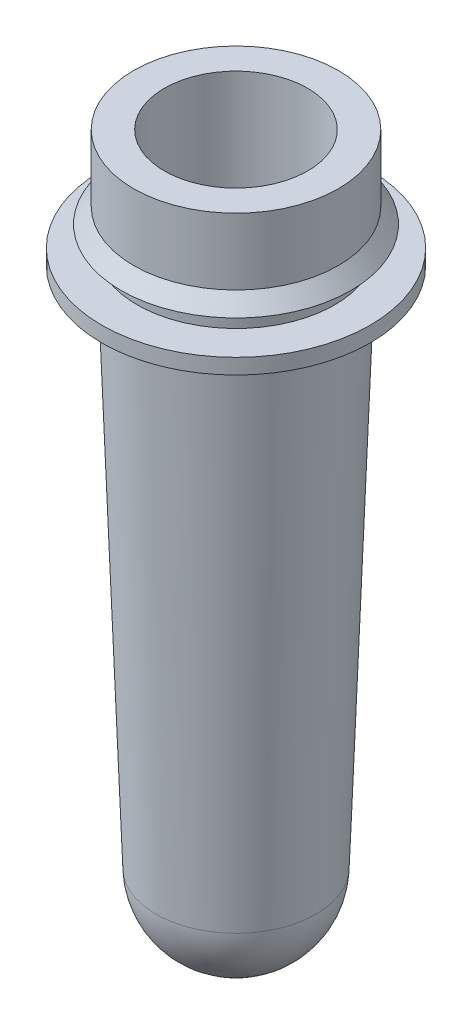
ISO-10303-21;
HEADER;
FILE_DESCRIPTION(('STEP AP214'),'2;1');
FILE_NAME('part.step','',(''),(''),'','','');
FILE_SCHEMA(('AUTOMOTIVE_DESIGN { 1 0 10303 214 1 1 1 1 }'));
ENDSEC;
DATA;
#1=APPLICATION_CONTEXT('core data for automotive mechanical design processes');
#2=APPLICATION_PROTOCOL_DEFINITION('international standard','automotive_design',2000,#1);
#3=PRODUCT_CONTEXT('',#1,'mechanical');
#4=PRODUCT('Part','Part','',(#3));
#5=PRODUCT_RELATED_PRODUCT_CATEGORY('part','',(#4));
#6=PRODUCT_DEFINITION_FORMATION('','',#4);
#7=PRODUCT_DEFINITION_CONTEXT('part definition',#1,'design');
#8=PRODUCT_DEFINITION('design','',#6,#7);
#9=PRODUCT_DEFINITION_SHAPE('','',#8);
#10=(LENGTH_UNIT() NAMED_UNIT(*) SI_UNIT(.MILLI.,.METRE.));
#11=(NAMED_UNIT(*) PLANE_ANGLE_UNIT() SI_UNIT($,.RADIAN.));
#12=(NAMED_UNIT(*) SI_UNIT($,.STERADIAN.) SOLID_ANGLE_UNIT());
#13=UNCERTAINTY_MEASURE_WITH_UNIT(LENGTH_MEASURE(1.E-05),#10,'distance_accuracy_value','');
#14=(GEOMETRIC_REPRESENTATION_CONTEXT(3) GLOBAL_UNCERTAINTY_ASSIGNED_CONTEXT((#13)) GLOBAL_UNIT_ASSIGNED_CONTEXT((#10,
#11,#12)) REPRESENTATION_CONTEXT('',''));
#15=CARTESIAN_POINT('',(0.,0.,0.));
#16=DIRECTION('',(0.,0.,1.));
#17=DIRECTION('',(1.,0.,0.));
#18=AXIS2_PLACEMENT_3D('',#15,#16,#17);
#19=CARTESIAN_POINT('',(0.,58.5,0.));
#20=DIRECTION('',(0.,1.,0.));
#21=DIRECTION('',(0.,0.,1.));
#22=AXIS2_PLACEMENT_3D('',#19,#20,#21);
#23=CONICAL_SURFACE('',#22,6.5965825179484,0.0349065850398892);
#24=CARTESIAN_POINT('',(0.,7.65564199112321,0.));
#25=DIRECTION('',(0.,-1.,0.));
#26=DIRECTION('',(0.,0.,-1.));
#27=AXIS2_PLACEMENT_3D('',#24,#25,#26);
#28=CIRCLE('',#27,4.82105841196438);
#29=CARTESIAN_POINT('',(0.,7.65564199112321,-4.82105841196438));
#30=VERTEX_POINT('',#29);
#31=EDGE_CURVE('E10',#30,#30,#28,.T.);
#32=ORIENTED_EDGE('',*,*,#31,.T.);
#33=EDGE_LOOP('',(#32));
#34=FACE_BOUND('',#33,.T.);
#35=CARTESIAN_POINT('',(0.,58.5,0.));
#36=DIRECTION('',(0.,-1.,0.));
#37=DIRECTION('',(0.,0.,-1.));
#38=AXIS2_PLACEMENT_3D('',#35,#36,#37);
#39=CIRCLE('',#38,6.59658251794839);
#40=CARTESIAN_POINT('',(0.,58.5,-6.59658251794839));
#41=VERTEX_POINT('',#40);
#42=EDGE_CURVE('E78',#41,#41,#39,.T.);
#43=ORIENTED_EDGE('',*,*,#42,.F.);
#44=EDGE_LOOP('',(#43));
#45=FACE_BOUND('',#44,.T.);
#46=ADVANCED_FACE('F35',(#34,#45),#23,.F.);
#47=CARTESIAN_POINT('',(0.,7.82399706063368,0.));
#48=DIRECTION('',(0.,-1.,0.));
#49=DIRECTION('',(0.,0.,-1.));
#50=AXIS2_PLACEMENT_3D('',#47,#48,#49);
#51=SPHERICAL_SURFACE('',#50,4.82399706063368);
#52=ORIENTED_EDGE('',*,*,#31,.F.);
#53=EDGE_LOOP('',(#52));
#54=FACE_BOUND('',#53,.T.);
#55=ADVANCED_FACE('F86',(#54),#51,.F.);
#56=CARTESIAN_POINT('',(0.,7.82399706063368,0.));
#57=DIRECTION('',(0.,-1.,0.));
#58=DIRECTION('',(0.,0.,-1.));
#59=AXIS2_PLACEMENT_3D('',#56,#57,#58);
#60=SPHERICAL_SURFACE('',#59,7.82399706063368);
#61=CARTESIAN_POINT('',(0.,7.5509435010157,0.));
#62=DIRECTION('',(0.,-1.,0.));
#63=DIRECTION('',(0.,0.,-1.));
#64=AXIS2_PLACEMENT_3D('',#61,#62,#63);
#65=CIRCLE('',#64,7.81923089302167);
#66=CARTESIAN_POINT('',(0.,7.5509435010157,-7.81923089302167));
#67=VERTEX_POINT('',#66);
#68=EDGE_CURVE('E41',#67,#67,#65,.T.);
#69=ORIENTED_EDGE('',*,*,#68,.T.);
#70=EDGE_LOOP('',(#69));
#71=FACE_BOUND('',#70,.T.);
#72=ADVANCED_FACE('F90',(#71),#60,.T.);
#73=CARTESIAN_POINT('',(0.,58.5,0.));
#74=DIRECTION('',(0.,1.,0.));
#75=DIRECTION('',(0.,0.,1.));
#76=AXIS2_PLACEMENT_3D('',#73,#74,#75);
#77=CONICAL_SURFACE('',#76,9.59841115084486,0.0349065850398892);
#78=ORIENTED_EDGE('',*,*,#68,.F.);
#79=EDGE_LOOP('',(#78));
#80=FACE_BOUND('',#79,.T.);
#81=CARTESIAN_POINT('',(0.,58.5,0.));
#82=DIRECTION('',(0.,-1.,0.));
#83=DIRECTION('',(0.,0.,-1.));
#84=AXIS2_PLACEMENT_3D('',#81,#82,#83);
#85=CIRCLE('',#84,9.59841115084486);
#86=CARTESIAN_POINT('',(0.,58.5,-9.59841115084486));
#87=VERTEX_POINT('',#86);
#88=EDGE_CURVE('E45',#87,#87,#85,.T.);
#89=ORIENTED_EDGE('',*,*,#88,.T.);
#90=EDGE_LOOP('',(#89));
#91=FACE_BOUND('',#90,.T.);
#92=ADVANCED_FACE('F95',(#80,#91),#77,.T.);
#93=CARTESIAN_POINT('',(0.,58.5,0.));
#94=DIRECTION('',(0.,1.,0.));
#95=DIRECTION('',(0.,0.,1.));
#96=AXIS2_PLACEMENT_3D('',#93,#94,#95);
#97=PLANE('',#96);
#98=ORIENTED_EDGE('',*,*,#88,.F.);
#99=EDGE_LOOP('',(#98));
#100=FACE_BOUND('',#99,.T.);
#101=CARTESIAN_POINT('',(0.,58.5,0.));
#102=DIRECTION('',(0.,-1.,0.));
#103=DIRECTION('',(0.,0.,-1.));
#104=AXIS2_PLACEMENT_3D('',#101,#102,#103);
#105=CIRCLE('',#104,13.0984111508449);
#106=CARTESIAN_POINT('',(0.,58.5,-13.0984111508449));
#107=VERTEX_POINT('',#106);
#108=EDGE_CURVE('E49',#107,#107,#105,.T.);
#109=ORIENTED_EDGE('',*,*,#108,.T.);
#110=EDGE_LOOP('',(#109));
#111=FACE_BOUND('',#110,.T.);
#112=ADVANCED_FACE('F100',(#100,#111),#97,.F.);
#113=CARTESIAN_POINT('',(0.,0.,0.));
#114=DIRECTION('',(0.,-1.,0.));
#115=DIRECTION('',(0.,0.,-1.));
#116=AXIS2_PLACEMENT_3D('',#113,#114,#115);
#117=CYLINDRICAL_SURFACE('',#116,13.0984111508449);
#118=ORIENTED_EDGE('',*,*,#108,.F.);
#119=EDGE_LOOP('',(#118));
#120=FACE_BOUND('',#119,.T.);
#121=CARTESIAN_POINT('',(0.,60.,0.));
#122=DIRECTION('',(0.,-1.,0.));
#123=DIRECTION('',(0.,0.,-1.));
#124=AXIS2_PLACEMENT_3D('',#121,#122,#123);
#125=CIRCLE('',#124,13.0984111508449);
#126=CARTESIAN_POINT('',(0.,60.,-13.0984111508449));
#127=VERTEX_POINT('',#126);
#128=EDGE_CURVE('E54',#127,#127,#125,.T.);
#129=ORIENTED_EDGE('',*,*,#128,.T.);
#130=EDGE_LOOP('',(#129));
#131=FACE_BOUND('',#130,.T.);
#132=ADVANCED_FACE('F104',(#120,#131),#117,.T.);
#133=CARTESIAN_POINT('',(0.,60.,1.20759762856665E-13));
#134=DIRECTION('',(0.,-1.,0.));
#135=DIRECTION('',(0.,0.,-1.));
#136=AXIS2_PLACEMENT_3D('',#133,#134,#135);
#137=PLANE('',#136);
#138=ORIENTED_EDGE('',*,*,#128,.F.);
#139=EDGE_LOOP('',(#138));
#140=FACE_BOUND('',#139,.T.);
#141=CARTESIAN_POINT('',(0.,60.,0.));
#142=DIRECTION('',(0.,-1.,0.));
#143=DIRECTION('',(0.,0.,-1.));
#144=AXIS2_PLACEMENT_3D('',#141,#142,#143);
#145=CIRCLE('',#144,9.65079230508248);
#146=CARTESIAN_POINT('',(0.,60.,-9.65079230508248));
#147=VERTEX_POINT('',#146);
#148=EDGE_CURVE('E57',#147,#147,#145,.T.);
#149=ORIENTED_EDGE('',*,*,#148,.T.);
#150=EDGE_LOOP('',(#149));
#151=FACE_BOUND('',#150,.T.);
#152=ADVANCED_FACE('F108',(#140,#151),#137,.F.);
#153=CARTESIAN_POINT('',(0.,62.,0.));
#154=DIRECTION('',(0.,1.,0.));
#155=DIRECTION('',(0.,0.,1.));
#156=AXIS2_PLACEMENT_3D('',#153,#154,#155);
#157=CONICAL_SURFACE('',#156,9.72063384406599,0.0349065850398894);
#158=ORIENTED_EDGE('',*,*,#148,.F.);
#159=EDGE_LOOP('',(#158));
#160=FACE_BOUND('',#159,.T.);
#161=CARTESIAN_POINT('',(0.,62.,0.));
#162=DIRECTION('',(0.,-1.,0.));
#163=DIRECTION('',(0.,0.,-1.));
#164=AXIS2_PLACEMENT_3D('',#161,#162,#163);
#165=CIRCLE('',#164,9.72063384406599);
#166=CARTESIAN_POINT('',(0.,62.,-9.72063384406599));
#167=VERTEX_POINT('',#166);
#168=EDGE_CURVE('E60',#167,#167,#165,.T.);
#169=ORIENTED_EDGE('',*,*,#168,.T.);
#170=EDGE_LOOP('',(#169));
#171=FACE_BOUND('',#170,.T.);
#172=ADVANCED_FACE('F112',(#160,#171),#157,.T.);
#173=CARTESIAN_POINT('',(0.,62.,2.86807614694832E-13));
#174=DIRECTION('',(0.,1.,0.));
#175=DIRECTION('',(0.,0.,1.));
#176=AXIS2_PLACEMENT_3D('',#173,#174,#175);
#177=PLANE('',#176);
#178=ORIENTED_EDGE('',*,*,#168,.F.);
#179=EDGE_LOOP('',(#178));
#180=FACE_BOUND('',#179,.T.);
#181=CARTESIAN_POINT('',(0.,62.,0.));
#182=DIRECTION('',(0.,-1.,0.));
#183=DIRECTION('',(0.,0.,-1.));
#184=AXIS2_PLACEMENT_3D('',#181,#182,#183);
#185=CIRCLE('',#184,11.220633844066);
#186=CARTESIAN_POINT('',(0.,62.,-11.220633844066));
#187=VERTEX_POINT('',#186);
#188=EDGE_CURVE('E63',#187,#187,#185,.T.);
#189=ORIENTED_EDGE('',*,*,#188,.T.);
#190=EDGE_LOOP('',(#189));
#191=FACE_BOUND('',#190,.T.);
#192=ADVANCED_FACE('F116',(#180,#191),#177,.F.);
#193=CARTESIAN_POINT('',(0.,63.5,0.));
#194=DIRECTION('',(0.,-1.,0.));
#195=DIRECTION('',(0.,0.,-1.));
#196=AXIS2_PLACEMENT_3D('',#193,#194,#195);
#197=CONICAL_SURFACE('',#196,9.99999999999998,0.683072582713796);
#198=ORIENTED_EDGE('',*,*,#188,.F.);
#199=EDGE_LOOP('',(#198));
#200=FACE_BOUND('',#199,.T.);
#201=CARTESIAN_POINT('',(0.,63.5,0.));
#202=DIRECTION('',(0.,-1.,0.));
#203=DIRECTION('',(0.,0.,-1.));
#204=AXIS2_PLACEMENT_3D('',#201,#202,#203);
#205=CIRCLE('',#204,9.99999999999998);
#206=CARTESIAN_POINT('',(0.,63.5,-9.99999999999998));
#207=VERTEX_POINT('',#206);
#208=EDGE_CURVE('E66',#207,#207,#205,.T.);
#209=ORIENTED_EDGE('',*,*,#208,.T.);
#210=EDGE_LOOP('',(#209));
#211=FACE_BOUND('',#210,.T.);
#212=ADVANCED_FACE('F120',(#200,#211),#197,.T.);
#213=CARTESIAN_POINT('',(0.,0.,0.));
#214=DIRECTION('',(0.,-1.,0.));
#215=DIRECTION('',(0.,0.,-1.));
#216=AXIS2_PLACEMENT_3D('',#213,#214,#215);
#217=CYLINDRICAL_SURFACE('',#216,9.99999999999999);
#218=ORIENTED_EDGE('',*,*,#208,.F.);
#219=EDGE_LOOP('',(#218));
#220=FACE_BOUND('',#219,.T.);
#221=CARTESIAN_POINT('',(0.,70.,0.));
#222=DIRECTION('',(0.,-1.,0.));
#223=DIRECTION('',(0.,0.,-1.));
#224=AXIS2_PLACEMENT_3D('',#221,#222,#223);
#225=CIRCLE('',#224,10.);
#226=CARTESIAN_POINT('',(0.,70.,-10.));
#227=VERTEX_POINT('',#226);
#228=EDGE_CURVE('E69',#227,#227,#225,.T.);
#229=ORIENTED_EDGE('',*,*,#228,.T.);
#230=EDGE_LOOP('',(#229));
#231=FACE_BOUND('',#230,.T.);
#232=ADVANCED_FACE('F124',(#220,#231),#217,.T.);
#233=CARTESIAN_POINT('',(0.,70.,0.));
#234=DIRECTION('',(0.,1.,0.));
#235=DIRECTION('',(0.,0.,1.));
#236=AXIS2_PLACEMENT_3D('',#233,#234,#235);
#237=PLANE('',#236);
#238=CARTESIAN_POINT('',(0.,70.,0.));
#239=DIRECTION('',(0.,-1.,0.));
#240=DIRECTION('',(0.,0.,-1.));
#241=AXIS2_PLACEMENT_3D('',#238,#239,#240);
#242=CIRCLE('',#241,7.);
#243=CARTESIAN_POINT('',(0.,70.,-7.));
#244=VERTEX_POINT('',#243);
#245=EDGE_CURVE('E72',#244,#244,#242,.T.);
#246=ORIENTED_EDGE('',*,*,#245,.T.);
#247=EDGE_LOOP('',(#246));
#248=FACE_BOUND('',#247,.T.);
#249=ORIENTED_EDGE('',*,*,#228,.F.);
#250=EDGE_LOOP('',(#249));
#251=FACE_BOUND('',#250,.T.);
#252=ADVANCED_FACE('F128',(#248,#251),#237,.T.);
#253=CARTESIAN_POINT('',(0.,0.,0.));
#254=DIRECTION('',(0.,-1.,0.));
#255=DIRECTION('',(0.,0.,-1.));
#256=AXIS2_PLACEMENT_3D('',#253,#254,#255);
#257=CYLINDRICAL_SURFACE('',#256,7.);
#258=CARTESIAN_POINT('',(0.,60.,0.));
#259=DIRECTION('',(0.,-1.,0.));
#260=DIRECTION('',(0.,0.,-1.));
#261=AXIS2_PLACEMENT_3D('',#258,#259,#260);
#262=CIRCLE('',#261,7.);
#263=CARTESIAN_POINT('',(0.,60.,-7.));
#264=VERTEX_POINT('',#263);
#265=EDGE_CURVE('E75',#264,#264,#262,.T.);
#266=ORIENTED_EDGE('',*,*,#265,.T.);
#267=EDGE_LOOP('',(#266));
#268=FACE_BOUND('',#267,.T.);
#269=ORIENTED_EDGE('',*,*,#245,.F.);
#270=EDGE_LOOP('',(#269));
#271=FACE_BOUND('',#270,.T.);
#272=ADVANCED_FACE('F132',(#268,#271),#257,.F.);
#273=CARTESIAN_POINT('',(0.,60.,0.));
#274=DIRECTION('',(0.,1.,0.));
#275=DIRECTION('',(0.,0.,1.));
#276=AXIS2_PLACEMENT_3D('',#273,#274,#275);
#277=CONICAL_SURFACE('',#276,7.,0.262728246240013);
#278=ORIENTED_EDGE('',*,*,#42,.T.);
#279=EDGE_LOOP('',(#278));
#280=FACE_BOUND('',#279,.T.);
#281=ORIENTED_EDGE('',*,*,#265,.F.);
#282=EDGE_LOOP('',(#281));
#283=FACE_BOUND('',#282,.T.);
#284=ADVANCED_FACE('F82',(#280,#283),#277,.F.);
#285=CLOSED_SHELL('',(#46,#55,#72,#92,#112,#132,#152,#172,#192,#212,#232,#252,#272,#284));
#286=MANIFOLD_SOLID_BREP('B2',#285);
#287=ADVANCED_BREP_SHAPE_REPRESENTATION('',(#18,#286),#14);
#288=SHAPE_DEFINITION_REPRESENTATION(#9,#287);
ENDSEC;
END-ISO-10303-21;
